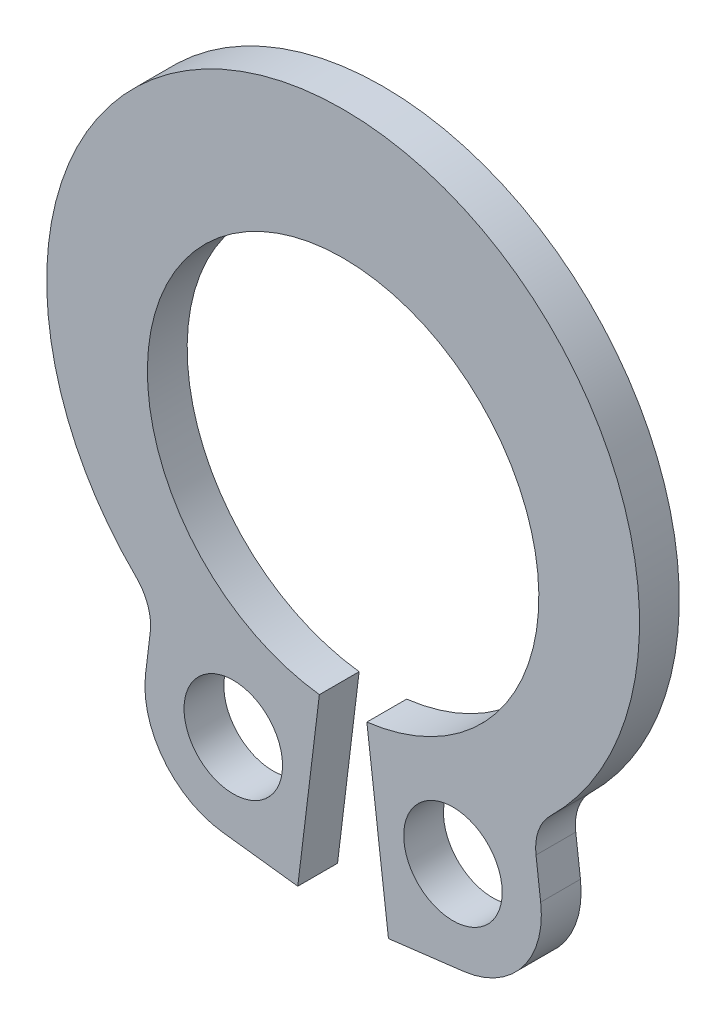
ISO-10303-21;
HEADER;
FILE_DESCRIPTION(('STEP AP214'),'2;1');
FILE_NAME('part.step','',(''),(''),'','','');
FILE_SCHEMA(('AUTOMOTIVE_DESIGN { 1 0 10303 214 1 1 1 1 }'));
ENDSEC;
DATA;
#1=APPLICATION_CONTEXT('core data for automotive mechanical design processes');
#2=APPLICATION_PROTOCOL_DEFINITION('international standard','automotive_design',2000,#1);
#3=PRODUCT_CONTEXT('',#1,'mechanical');
#4=PRODUCT('Part','Part','',(#3));
#5=PRODUCT_RELATED_PRODUCT_CATEGORY('part','',(#4));
#6=PRODUCT_DEFINITION_FORMATION('','',#4);
#7=PRODUCT_DEFINITION_CONTEXT('part definition',#1,'design');
#8=PRODUCT_DEFINITION('design','',#6,#7);
#9=PRODUCT_DEFINITION_SHAPE('','',#8);
#10=(LENGTH_UNIT() NAMED_UNIT(*) SI_UNIT(.MILLI.,.METRE.));
#11=(NAMED_UNIT(*) PLANE_ANGLE_UNIT() SI_UNIT($,.RADIAN.));
#12=(NAMED_UNIT(*) SI_UNIT($,.STERADIAN.) SOLID_ANGLE_UNIT());
#13=UNCERTAINTY_MEASURE_WITH_UNIT(LENGTH_MEASURE(1.E-05),#10,'distance_accuracy_value','');
#14=(GEOMETRIC_REPRESENTATION_CONTEXT(3) GLOBAL_UNCERTAINTY_ASSIGNED_CONTEXT((#13)) GLOBAL_UNIT_ASSIGNED_CONTEXT((#10,
#11,#12)) REPRESENTATION_CONTEXT('',''));
#15=CARTESIAN_POINT('',(0.,0.,0.));
#16=DIRECTION('',(0.,0.,1.));
#17=DIRECTION('',(1.,0.,0.));
#18=AXIS2_PLACEMENT_3D('',#15,#16,#17);
#19=CARTESIAN_POINT('',(0.,0.,-0.799999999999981));
#20=DIRECTION('',(0.,0.,1.));
#21=DIRECTION('',(0.999999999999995,0.,0.));
#22=AXIS2_PLACEMENT_3D('',#19,#20,#21);
#23=CYLINDRICAL_SURFACE('',#22,3.937);
#24=CARTESIAN_POINT('',(0.,0.,0.));
#25=DIRECTION('',(0.,0.,-1.));
#26=DIRECTION('',(0.999999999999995,0.,0.));
#27=AXIS2_PLACEMENT_3D('',#24,#25,#26);
#28=CIRCLE('',#27,3.937);
#29=CARTESIAN_POINT('',(-0.477599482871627,-3.90792371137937,-7.49400541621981E-13));
#30=VERTEX_POINT('',#29);
#31=CARTESIAN_POINT('',(0.477599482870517,-3.90792371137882,0.));
#32=VERTEX_POINT('',#31);
#33=EDGE_CURVE('E155',#30,#32,#28,.T.);
#34=ORIENTED_EDGE('',*,*,#33,.F.);
#35=DIRECTION('',(0.,0.,1.));
#36=VECTOR('',#35,1.);
#37=CARTESIAN_POINT('',(-0.477599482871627,-3.90792371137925,-0.800000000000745));
#38=LINE('',#37,#36);
#39=CARTESIAN_POINT('',(-0.477599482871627,-3.90792371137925,-0.800000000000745));
#40=VERTEX_POINT('',#39);
#41=EDGE_CURVE('E11',#40,#30,#38,.T.);
#42=ORIENTED_EDGE('',*,*,#41,.F.);
#43=CARTESIAN_POINT('',(0.,0.,-0.799999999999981));
#44=DIRECTION('',(0.,0.,-1.));
#45=DIRECTION('',(0.999999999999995,0.,0.));
#46=AXIS2_PLACEMENT_3D('',#43,#44,#45);
#47=CIRCLE('',#46,3.937);
#48=CARTESIAN_POINT('',(0.47759948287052,-3.90792371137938,-0.800000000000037));
#49=VERTEX_POINT('',#48);
#50=EDGE_CURVE('E188',#40,#49,#47,.T.);
#51=ORIENTED_EDGE('',*,*,#50,.T.);
#52=DIRECTION('',(0.,0.,1.));
#53=VECTOR('',#52,1.);
#54=CARTESIAN_POINT('',(0.47759948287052,-3.90792371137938,-0.800000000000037));
#55=LINE('',#54,#53);
#56=EDGE_CURVE('E37',#49,#32,#55,.T.);
#57=ORIENTED_EDGE('',*,*,#56,.T.);
#58=EDGE_LOOP('',(#34,#42,#51,#57));
#59=FACE_BOUND('',#58,.T.);
#60=ADVANCED_FACE('F34',(#59),#23,.F.);
#61=CARTESIAN_POINT('',(-0.477599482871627,-3.90792371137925,-0.800000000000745));
#62=DIRECTION('',(0.992614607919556,-0.121310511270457,0.));
#63=DIRECTION('',(0.121310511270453,0.992614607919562,0.));
#64=AXIS2_PLACEMENT_3D('',#61,#62,#63);
#65=PLANE('',#64);
#66=DIRECTION('',(0.121310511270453,0.992614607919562,0.));
#67=VECTOR('',#66,1.);
#68=CARTESIAN_POINT('',(-0.477599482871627,-3.90792371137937,-7.49400541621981E-13));
#69=LINE('',#68,#67);
#70=CARTESIAN_POINT('',(-0.91206094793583,-7.4628736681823,0.));
#71=VERTEX_POINT('',#70);
#72=EDGE_CURVE('E186',#71,#30,#69,.T.);
#73=ORIENTED_EDGE('',*,*,#72,.F.);
#74=DIRECTION('',(0.,0.,1.));
#75=VECTOR('',#74,1.);
#76=CARTESIAN_POINT('',(-0.912060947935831,-7.46287366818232,-0.800000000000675));
#77=LINE('',#76,#75);
#78=CARTESIAN_POINT('',(-0.912060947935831,-7.46287366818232,-0.800000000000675));
#79=VERTEX_POINT('',#78);
#80=EDGE_CURVE('E43',#79,#71,#77,.T.);
#81=ORIENTED_EDGE('',*,*,#80,.F.);
#82=DIRECTION('',(0.121310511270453,0.992614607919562,0.));
#83=VECTOR('',#82,1.);
#84=CARTESIAN_POINT('',(-0.477599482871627,-3.90792371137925,-0.800000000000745));
#85=LINE('',#84,#83);
#86=EDGE_CURVE('E145',#79,#40,#85,.T.);
#87=ORIENTED_EDGE('',*,*,#86,.T.);
#88=ORIENTED_EDGE('',*,*,#41,.T.);
#89=EDGE_LOOP('',(#73,#81,#87,#88));
#90=FACE_BOUND('',#89,.T.);
#91=ADVANCED_FACE('F208',(#90),#65,.T.);
#92=CARTESIAN_POINT('',(-0.912060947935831,-7.46287366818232,-0.800000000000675));
#93=DIRECTION('',(-0.121310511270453,-0.992614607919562,0.));
#94=DIRECTION('',(0.992614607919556,-0.121310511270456,0.));
#95=AXIS2_PLACEMENT_3D('',#92,#93,#94);
#96=PLANE('',#95);
#97=DIRECTION('',(0.992614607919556,-0.121310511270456,0.));
#98=VECTOR('',#97,1.);
#99=CARTESIAN_POINT('',(-0.91206094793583,-7.4628736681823,0.));
#100=LINE('',#99,#98);
#101=CARTESIAN_POINT('',(-2.42480561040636,-7.27799644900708,-5.27355936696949E-13));
#102=VERTEX_POINT('',#101);
#103=EDGE_CURVE('E132',#102,#71,#100,.T.);
#104=ORIENTED_EDGE('',*,*,#103,.F.);
#105=DIRECTION('',(0.,0.,1.));
#106=VECTOR('',#105,1.);
#107=CARTESIAN_POINT('',(-2.42480561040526,-7.27799644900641,-0.799999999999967));
#108=LINE('',#107,#106);
#109=CARTESIAN_POINT('',(-2.42480561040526,-7.27799644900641,-0.799999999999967));
#110=VERTEX_POINT('',#109);
#111=EDGE_CURVE('E127',#110,#102,#108,.T.);
#112=ORIENTED_EDGE('',*,*,#111,.F.);
#113=DIRECTION('',(0.992614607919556,-0.121310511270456,0.));
#114=VECTOR('',#113,1.);
#115=CARTESIAN_POINT('',(-0.912060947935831,-7.46287366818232,-0.800000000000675));
#116=LINE('',#115,#114);
#117=EDGE_CURVE('E130',#110,#79,#116,.T.);
#118=ORIENTED_EDGE('',*,*,#117,.T.);
#119=ORIENTED_EDGE('',*,*,#80,.T.);
#120=EDGE_LOOP('',(#104,#112,#118,#119));
#121=FACE_BOUND('',#120,.T.);
#122=ADVANCED_FACE('F129',(#121),#96,.T.);
#123=CARTESIAN_POINT('',(-2.20911552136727,-5.51312767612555,-0.800000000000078));
#124=DIRECTION('',(0.,0.,1.));
#125=DIRECTION('',(0.999999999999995,0.,0.));
#126=AXIS2_PLACEMENT_3D('',#123,#124,#125);
#127=CYLINDRICAL_SURFACE('',#126,1.778);
#128=CARTESIAN_POINT('',(-2.20911552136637,-5.51312767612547,0.));
#129=DIRECTION('',(0.,0.,1.));
#130=DIRECTION('',(0.999999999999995,0.,0.));
#131=AXIS2_PLACEMENT_3D('',#128,#129,#130);
#132=CIRCLE('',#131,1.778);
#133=CARTESIAN_POINT('',(-3.97398429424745,-5.29743758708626,-7.84095011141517E-13));
#134=VERTEX_POINT('',#133);
#135=EDGE_CURVE('E183',#134,#102,#132,.T.);
#136=ORIENTED_EDGE('',*,*,#135,.F.);
#137=DIRECTION('',(0.,0.,1.));
#138=VECTOR('',#137,1.);
#139=CARTESIAN_POINT('',(-3.97398429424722,-5.29743758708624,-0.800000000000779));
#140=LINE('',#139,#138);
#141=CARTESIAN_POINT('',(-3.97398429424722,-5.29743758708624,-0.800000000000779));
#142=VERTEX_POINT('',#141);
#143=EDGE_CURVE('E137',#142,#134,#140,.T.);
#144=ORIENTED_EDGE('',*,*,#143,.F.);
#145=CARTESIAN_POINT('',(-2.20911552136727,-5.51312767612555,-0.800000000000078));
#146=DIRECTION('',(0.,0.,1.));
#147=DIRECTION('',(0.999999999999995,0.,0.));
#148=AXIS2_PLACEMENT_3D('',#145,#146,#147);
#149=CIRCLE('',#148,1.778);
#150=EDGE_CURVE('E143',#142,#110,#149,.T.);
#151=ORIENTED_EDGE('',*,*,#150,.T.);
#152=ORIENTED_EDGE('',*,*,#111,.T.);
#153=EDGE_LOOP('',(#136,#144,#151,#152));
#154=FACE_BOUND('',#153,.T.);
#155=ADVANCED_FACE('F147',(#154),#127,.T.);
#156=CARTESIAN_POINT('',(-3.87942912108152,-4.52374662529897,-0.799999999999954));
#157=DIRECTION('',(-0.992614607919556,0.121310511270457,0.));
#158=DIRECTION('',(-0.121310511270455,-0.992614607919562,0.));
#159=AXIS2_PLACEMENT_3D('',#156,#157,#158);
#160=PLANE('',#159);
#161=DIRECTION('',(-0.121310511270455,-0.992614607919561,0.));
#162=VECTOR('',#161,1.);
#163=CARTESIAN_POINT('',(-3.8794291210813,-4.52374662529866,0.));
#164=LINE('',#163,#162);
#165=CARTESIAN_POINT('',(-3.8794291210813,-4.52374662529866,0.));
#166=VERTEX_POINT('',#165);
#167=EDGE_CURVE('E180',#166,#134,#164,.T.);
#168=ORIENTED_EDGE('',*,*,#167,.F.);
#169=DIRECTION('',(0.,0.,1.));
#170=VECTOR('',#169,1.);
#171=CARTESIAN_POINT('',(-3.87942912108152,-4.52374662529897,-0.799999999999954));
#172=LINE('',#171,#170);
#173=CARTESIAN_POINT('',(-3.87942912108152,-4.52374662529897,-0.799999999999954));
#174=VERTEX_POINT('',#173);
#175=EDGE_CURVE('E192',#174,#166,#172,.T.);
#176=ORIENTED_EDGE('',*,*,#175,.F.);
#177=DIRECTION('',(-0.121310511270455,-0.992614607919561,0.));
#178=VECTOR('',#177,1.);
#179=CARTESIAN_POINT('',(-3.87942912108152,-4.52374662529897,-0.799999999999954));
#180=LINE('',#179,#178);
#181=EDGE_CURVE('E148',#174,#142,#180,.T.);
#182=ORIENTED_EDGE('',*,*,#181,.T.);
#183=ORIENTED_EDGE('',*,*,#143,.T.);
#184=EDGE_LOOP('',(#168,#176,#182,#183));
#185=FACE_BOUND('',#184,.T.);
#186=ADVANCED_FACE('F221',(#185),#160,.T.);
#187=CARTESIAN_POINT('',(-4.86271315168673,-4.40357643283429,-0.799999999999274));
#188=DIRECTION('',(0.,0.,1.));
#189=DIRECTION('',(0.999999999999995,0.,0.));
#190=AXIS2_PLACEMENT_3D('',#187,#188,#189);
#191=CYLINDRICAL_SURFACE('',#190,0.990599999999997);
#192=CARTESIAN_POINT('',(-4.86271315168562,-4.40357643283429,-7.7715611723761E-13));
#193=DIRECTION('',(0.,0.,-1.));
#194=DIRECTION('',(0.999999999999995,0.,0.));
#195=AXIS2_PLACEMENT_3D('',#192,#193,#194);
#196=CIRCLE('',#195,0.990599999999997);
#197=CARTESIAN_POINT('',(-4.16988679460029,-3.69556513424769,0.));
#198=VERTEX_POINT('',#197);
#199=EDGE_CURVE('E177',#198,#166,#196,.T.);
#200=ORIENTED_EDGE('',*,*,#199,.F.);
#201=DIRECTION('',(0.,0.,1.));
#202=VECTOR('',#201,1.);
#203=CARTESIAN_POINT('',(-4.16988679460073,-3.69556513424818,-0.800000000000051));
#204=LINE('',#203,#202);
#205=CARTESIAN_POINT('',(-4.16988679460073,-3.69556513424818,-0.800000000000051));
#206=VERTEX_POINT('',#205);
#207=EDGE_CURVE('E194',#206,#198,#204,.T.);
#208=ORIENTED_EDGE('',*,*,#207,.F.);
#209=CARTESIAN_POINT('',(-4.86271315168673,-4.40357643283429,-0.799999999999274));
#210=DIRECTION('',(0.,0.,-1.));
#211=DIRECTION('',(0.999999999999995,0.,0.));
#212=AXIS2_PLACEMENT_3D('',#209,#210,#211);
#213=CIRCLE('',#212,0.990599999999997);
#214=EDGE_CURVE('E150',#206,#174,#213,.T.);
#215=ORIENTED_EDGE('',*,*,#214,.T.);
#216=ORIENTED_EDGE('',*,*,#175,.T.);
#217=EDGE_LOOP('',(#200,#208,#215,#216));
#218=FACE_BOUND('',#217,.T.);
#219=ADVANCED_FACE('F224',(#218),#191,.F.);
#220=CARTESIAN_POINT('',(-1.55344487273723E-12,0.565714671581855,-0.800000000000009));
#221=DIRECTION('',(0.,0.,1.));
#222=DIRECTION('',(0.999999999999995,0.,0.));
#223=AXIS2_PLACEMENT_3D('',#220,#221,#222);
#224=CYLINDRICAL_SURFACE('',#223,5.96208532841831);
#225=CARTESIAN_POINT('',(-1.9966667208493E-12,0.565714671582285,0.));
#226=DIRECTION('',(0.,0.,1.));
#227=DIRECTION('',(0.999999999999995,0.,0.));
#228=AXIS2_PLACEMENT_3D('',#225,#226,#227);
#229=CIRCLE('',#228,5.96208532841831);
#230=CARTESIAN_POINT('',(4.16988679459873,-3.69556513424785,0.));
#231=VERTEX_POINT('',#230);
#232=EDGE_CURVE('E174',#231,#198,#229,.T.);
#233=ORIENTED_EDGE('',*,*,#232,.F.);
#234=DIRECTION('',(0.,0.,1.));
#235=VECTOR('',#234,1.);
#236=CARTESIAN_POINT('',(4.16988679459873,-3.69556513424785,-0.799999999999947));
#237=LINE('',#236,#235);
#238=CARTESIAN_POINT('',(4.16988679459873,-3.69556513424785,-0.799999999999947));
#239=VERTEX_POINT('',#238);
#240=EDGE_CURVE('E196',#239,#231,#237,.T.);
#241=ORIENTED_EDGE('',*,*,#240,.F.);
#242=CARTESIAN_POINT('',(-1.55344487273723E-12,0.565714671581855,-0.800000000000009));
#243=DIRECTION('',(0.,0.,1.));
#244=DIRECTION('',(0.999999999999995,0.,0.));
#245=AXIS2_PLACEMENT_3D('',#242,#243,#244);
#246=CIRCLE('',#245,5.96208532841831);
#247=EDGE_CURVE('E298',#239,#206,#246,.T.);
#248=ORIENTED_EDGE('',*,*,#247,.T.);
#249=ORIENTED_EDGE('',*,*,#207,.T.);
#250=EDGE_LOOP('',(#233,#241,#248,#249));
#251=FACE_BOUND('',#250,.T.);
#252=ADVANCED_FACE('F228',(#251),#224,.T.);
#253=CARTESIAN_POINT('',(4.86271315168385,-4.4035764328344,-0.800000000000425));
#254=DIRECTION('',(0.,0.,1.));
#255=DIRECTION('',(0.999999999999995,0.,0.));
#256=AXIS2_PLACEMENT_3D('',#253,#254,#255);
#257=CYLINDRICAL_SURFACE('',#256,0.990599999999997);
#258=CARTESIAN_POINT('',(4.86271315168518,-4.40357643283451,0.));
#259=DIRECTION('',(0.,0.,-1.));
#260=DIRECTION('',(0.999999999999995,0.,0.));
#261=AXIS2_PLACEMENT_3D('',#258,#259,#260);
#262=CIRCLE('',#261,0.990599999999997);
#263=CARTESIAN_POINT('',(3.87942912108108,-4.52374662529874,0.));
#264=VERTEX_POINT('',#263);
#265=EDGE_CURVE('E171',#264,#231,#262,.T.);
#266=ORIENTED_EDGE('',*,*,#265,.F.);
#267=DIRECTION('',(0.,0.,1.));
#268=VECTOR('',#267,1.);
#269=CARTESIAN_POINT('',(3.87942912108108,-4.52374662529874,-0.799999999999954));
#270=LINE('',#269,#268);
#271=CARTESIAN_POINT('',(3.87942912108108,-4.52374662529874,-0.799999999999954));
#272=VERTEX_POINT('',#271);
#273=EDGE_CURVE('E198',#272,#264,#270,.T.);
#274=ORIENTED_EDGE('',*,*,#273,.F.);
#275=CARTESIAN_POINT('',(4.86271315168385,-4.4035764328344,-0.800000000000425));
#276=DIRECTION('',(0.,0.,-1.));
#277=DIRECTION('',(0.999999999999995,0.,0.));
#278=AXIS2_PLACEMENT_3D('',#275,#276,#277);
#279=CIRCLE('',#278,0.990599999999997);
#280=EDGE_CURVE('E295',#272,#239,#279,.T.);
#281=ORIENTED_EDGE('',*,*,#280,.T.);
#282=ORIENTED_EDGE('',*,*,#240,.T.);
#283=EDGE_LOOP('',(#266,#274,#281,#282));
#284=FACE_BOUND('',#283,.T.);
#285=ADVANCED_FACE('F232',(#284),#257,.F.);
#286=CARTESIAN_POINT('',(3.87942912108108,-4.52374662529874,-0.799999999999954));
#287=DIRECTION('',(0.992614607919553,0.121310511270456,0.));
#288=DIRECTION('',(-0.121310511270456,0.992614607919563,0.));
#289=AXIS2_PLACEMENT_3D('',#286,#287,#288);
#290=PLANE('',#289);
#291=DIRECTION('',(-0.121310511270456,0.992614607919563,0.));
#292=VECTOR('',#291,1.);
#293=CARTESIAN_POINT('',(3.87942912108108,-4.52374662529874,0.));
#294=LINE('',#293,#292);
#295=CARTESIAN_POINT('',(3.97398429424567,-5.29743758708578,0.));
#296=VERTEX_POINT('',#295);
#297=EDGE_CURVE('E168',#296,#264,#294,.T.);
#298=ORIENTED_EDGE('',*,*,#297,.F.);
#299=DIRECTION('',(0.,0.,1.));
#300=VECTOR('',#299,1.);
#301=CARTESIAN_POINT('',(3.97398429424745,-5.29743758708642,-0.800000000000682));
#302=LINE('',#301,#300);
#303=CARTESIAN_POINT('',(3.97398429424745,-5.29743758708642,-0.800000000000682));
#304=VERTEX_POINT('',#303);
#305=EDGE_CURVE('E200',#304,#296,#302,.T.);
#306=ORIENTED_EDGE('',*,*,#305,.F.);
#307=DIRECTION('',(-0.121310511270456,0.992614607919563,0.));
#308=VECTOR('',#307,1.);
#309=CARTESIAN_POINT('',(3.87942912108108,-4.52374662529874,-0.799999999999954));
#310=LINE('',#309,#308);
#311=EDGE_CURVE('E292',#304,#272,#310,.T.);
#312=ORIENTED_EDGE('',*,*,#311,.T.);
#313=ORIENTED_EDGE('',*,*,#273,.T.);
#314=EDGE_LOOP('',(#298,#306,#312,#313));
#315=FACE_BOUND('',#314,.T.);
#316=ADVANCED_FACE('F236',(#315),#290,.T.);
#317=CARTESIAN_POINT('',(2.2091155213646,-5.51312767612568,-0.800000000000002));
#318=DIRECTION('',(0.,0.,1.));
#319=DIRECTION('',(0.999999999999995,0.,0.));
#320=AXIS2_PLACEMENT_3D('',#317,#318,#319);
#321=CYLINDRICAL_SURFACE('',#320,1.778);
#322=CARTESIAN_POINT('',(2.20911552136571,-5.51312767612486,7.21644966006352E-13));
#323=DIRECTION('',(0.,0.,1.));
#324=DIRECTION('',(0.999999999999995,0.,0.));
#325=AXIS2_PLACEMENT_3D('',#322,#323,#324);
#326=CIRCLE('',#325,1.778);
#327=CARTESIAN_POINT('',(2.42480561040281,-7.27799644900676,-5.55111512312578E-13));
#328=VERTEX_POINT('',#327);
#329=EDGE_CURVE('E165',#328,#296,#326,.T.);
#330=ORIENTED_EDGE('',*,*,#329,.F.);
#331=DIRECTION('',(0.,0.,1.));
#332=VECTOR('',#331,1.);
#333=CARTESIAN_POINT('',(2.42480561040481,-7.27799644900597,-0.800000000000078));
#334=LINE('',#333,#332);
#335=CARTESIAN_POINT('',(2.42480561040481,-7.27799644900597,-0.800000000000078));
#336=VERTEX_POINT('',#335);
#337=EDGE_CURVE('E202',#336,#328,#334,.T.);
#338=ORIENTED_EDGE('',*,*,#337,.F.);
#339=CARTESIAN_POINT('',(2.2091155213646,-5.51312767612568,-0.800000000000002));
#340=DIRECTION('',(0.,0.,1.));
#341=DIRECTION('',(0.999999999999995,0.,0.));
#342=AXIS2_PLACEMENT_3D('',#339,#340,#341);
#343=CIRCLE('',#342,1.778);
#344=EDGE_CURVE('E289',#336,#304,#343,.T.);
#345=ORIENTED_EDGE('',*,*,#344,.T.);
#346=ORIENTED_EDGE('',*,*,#305,.T.);
#347=EDGE_LOOP('',(#330,#338,#345,#346));
#348=FACE_BOUND('',#347,.T.);
#349=ADVANCED_FACE('F240',(#348),#321,.T.);
#350=CARTESIAN_POINT('',(0.912060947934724,-7.46287366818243,-0.799999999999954));
#351=DIRECTION('',(0.121310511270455,-0.992614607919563,0.));
#352=DIRECTION('',(0.992614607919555,0.121310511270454,0.));
#353=AXIS2_PLACEMENT_3D('',#350,#351,#352);
#354=PLANE('',#353);
#355=DIRECTION('',(0.992614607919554,0.121310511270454,0.));
#356=VECTOR('',#355,1.);
#357=CARTESIAN_POINT('',(0.912060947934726,-7.46287366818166,7.42461647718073E-13));
#358=LINE('',#357,#356);
#359=CARTESIAN_POINT('',(0.912060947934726,-7.46287366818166,7.42461647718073E-13));
#360=VERTEX_POINT('',#359);
#361=EDGE_CURVE('E162',#360,#328,#358,.T.);
#362=ORIENTED_EDGE('',*,*,#361,.F.);
#363=DIRECTION('',(0.,0.,1.));
#364=VECTOR('',#363,1.);
#365=CARTESIAN_POINT('',(0.912060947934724,-7.46287366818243,-0.799999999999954));
#366=LINE('',#365,#364);
#367=CARTESIAN_POINT('',(0.912060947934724,-7.46287366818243,-0.799999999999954));
#368=VERTEX_POINT('',#367);
#369=EDGE_CURVE('E203',#368,#360,#366,.T.);
#370=ORIENTED_EDGE('',*,*,#369,.F.);
#371=DIRECTION('',(0.992614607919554,0.121310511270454,0.));
#372=VECTOR('',#371,1.);
#373=CARTESIAN_POINT('',(0.912060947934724,-7.46287366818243,-0.799999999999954));
#374=LINE('',#373,#372);
#375=EDGE_CURVE('E286',#368,#336,#374,.T.);
#376=ORIENTED_EDGE('',*,*,#375,.T.);
#377=ORIENTED_EDGE('',*,*,#337,.T.);
#378=EDGE_LOOP('',(#362,#370,#376,#377));
#379=FACE_BOUND('',#378,.T.);
#380=ADVANCED_FACE('F244',(#379),#354,.T.);
#381=CARTESIAN_POINT('',(0.47759948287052,-3.90792371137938,-0.800000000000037));
#382=DIRECTION('',(-0.992614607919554,-0.121310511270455,0.));
#383=DIRECTION('',(0.121310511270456,-0.992614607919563,0.));
#384=AXIS2_PLACEMENT_3D('',#381,#382,#383);
#385=PLANE('',#384);
#386=DIRECTION('',(0.121310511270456,-0.992614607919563,0.));
#387=VECTOR('',#386,1.);
#388=CARTESIAN_POINT('',(0.477599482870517,-3.90792371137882,0.));
#389=LINE('',#388,#387);
#390=EDGE_CURVE('E158',#32,#360,#389,.T.);
#391=ORIENTED_EDGE('',*,*,#390,.F.);
#392=ORIENTED_EDGE('',*,*,#56,.F.);
#393=DIRECTION('',(0.121310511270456,-0.992614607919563,0.));
#394=VECTOR('',#393,1.);
#395=CARTESIAN_POINT('',(0.47759948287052,-3.90792371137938,-0.800000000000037));
#396=LINE('',#395,#394);
#397=EDGE_CURVE('E284',#49,#368,#396,.T.);
#398=ORIENTED_EDGE('',*,*,#397,.T.);
#399=ORIENTED_EDGE('',*,*,#369,.T.);
#400=EDGE_LOOP('',(#391,#392,#398,#399));
#401=FACE_BOUND('',#400,.T.);
#402=ADVANCED_FACE('F205',(#401),#385,.T.);
#403=CARTESIAN_POINT('',(0.,0.,-0.799999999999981));
#404=DIRECTION('',(0.,0.,1.));
#405=DIRECTION('',(0.999999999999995,0.,0.));
#406=AXIS2_PLACEMENT_3D('',#403,#404,#405);
#407=PLANE('',#406);
#408=CARTESIAN_POINT('',(-2.20911552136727,-5.51312767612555,-0.800000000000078));
#409=DIRECTION('',(0.,0.,1.));
#410=DIRECTION('',(0.999999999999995,0.,0.));
#411=AXIS2_PLACEMENT_3D('',#408,#409,#410);
#412=CIRCLE('',#411,0.9906);
#413=CARTESIAN_POINT('',(-1.21851552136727,-5.51312767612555,-0.800000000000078));
#414=VERTEX_POINT('',#413);
#415=EDGE_CURVE('E271',#414,#414,#412,.T.);
#416=ORIENTED_EDGE('',*,*,#415,.T.);
#417=EDGE_LOOP('',(#416));
#418=FACE_BOUND('',#417,.T.);
#419=CARTESIAN_POINT('',(2.2091155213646,-5.51312767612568,-0.800000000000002));
#420=DIRECTION('',(0.,0.,1.));
#421=DIRECTION('',(0.999999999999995,0.,0.));
#422=AXIS2_PLACEMENT_3D('',#419,#420,#421);
#423=CIRCLE('',#422,0.9906);
#424=CARTESIAN_POINT('',(3.1997155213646,-5.51312767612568,-0.800000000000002));
#425=VERTEX_POINT('',#424);
#426=EDGE_CURVE('E159',#425,#425,#423,.T.);
#427=ORIENTED_EDGE('',*,*,#426,.T.);
#428=EDGE_LOOP('',(#427));
#429=FACE_BOUND('',#428,.T.);
#430=ORIENTED_EDGE('',*,*,#50,.F.);
#431=ORIENTED_EDGE('',*,*,#86,.F.);
#432=ORIENTED_EDGE('',*,*,#117,.F.);
#433=ORIENTED_EDGE('',*,*,#150,.F.);
#434=ORIENTED_EDGE('',*,*,#181,.F.);
#435=ORIENTED_EDGE('',*,*,#214,.F.);
#436=ORIENTED_EDGE('',*,*,#247,.F.);
#437=ORIENTED_EDGE('',*,*,#280,.F.);
#438=ORIENTED_EDGE('',*,*,#311,.F.);
#439=ORIENTED_EDGE('',*,*,#344,.F.);
#440=ORIENTED_EDGE('',*,*,#375,.F.);
#441=ORIENTED_EDGE('',*,*,#397,.F.);
#442=EDGE_LOOP('',(#430,#431,#432,#433,#434,#435,#436,#437,#438,#439,#440,#441));
#443=FACE_BOUND('',#442,.T.);
#444=ADVANCED_FACE('F141',(#418,#429,#443),#407,.F.);
#445=CARTESIAN_POINT('',(0.,0.,0.));
#446=DIRECTION('',(0.,0.,1.));
#447=DIRECTION('',(0.999999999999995,0.,0.));
#448=AXIS2_PLACEMENT_3D('',#445,#446,#447);
#449=PLANE('',#448);
#450=CARTESIAN_POINT('',(-2.20911552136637,-5.51312767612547,0.));
#451=DIRECTION('',(0.,0.,1.));
#452=DIRECTION('',(0.999999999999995,0.,0.));
#453=AXIS2_PLACEMENT_3D('',#450,#451,#452);
#454=CIRCLE('',#453,0.9906);
#455=CARTESIAN_POINT('',(-1.21851552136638,-5.51312767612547,0.));
#456=VERTEX_POINT('',#455);
#457=EDGE_CURVE('E274',#456,#456,#454,.T.);
#458=ORIENTED_EDGE('',*,*,#457,.F.);
#459=EDGE_LOOP('',(#458));
#460=FACE_BOUND('',#459,.T.);
#461=CARTESIAN_POINT('',(2.20911552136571,-5.51312767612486,7.21644966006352E-13));
#462=DIRECTION('',(0.,0.,1.));
#463=DIRECTION('',(0.999999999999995,0.,0.));
#464=AXIS2_PLACEMENT_3D('',#461,#462,#463);
#465=CIRCLE('',#464,0.9906);
#466=CARTESIAN_POINT('',(3.19971552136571,-5.51312767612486,7.22064259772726E-13));
#467=VERTEX_POINT('',#466);
#468=EDGE_CURVE('E276',#467,#467,#465,.T.);
#469=ORIENTED_EDGE('',*,*,#468,.F.);
#470=EDGE_LOOP('',(#469));
#471=FACE_BOUND('',#470,.T.);
#472=ORIENTED_EDGE('',*,*,#33,.T.);
#473=ORIENTED_EDGE('',*,*,#390,.T.);
#474=ORIENTED_EDGE('',*,*,#361,.T.);
#475=ORIENTED_EDGE('',*,*,#329,.T.);
#476=ORIENTED_EDGE('',*,*,#297,.T.);
#477=ORIENTED_EDGE('',*,*,#265,.T.);
#478=ORIENTED_EDGE('',*,*,#232,.T.);
#479=ORIENTED_EDGE('',*,*,#199,.T.);
#480=ORIENTED_EDGE('',*,*,#167,.T.);
#481=ORIENTED_EDGE('',*,*,#135,.T.);
#482=ORIENTED_EDGE('',*,*,#103,.T.);
#483=ORIENTED_EDGE('',*,*,#72,.T.);
#484=EDGE_LOOP('',(#472,#473,#474,#475,#476,#477,#478,#479,#480,#481,#482,#483));
#485=FACE_BOUND('',#484,.T.);
#486=ADVANCED_FACE('F207',(#460,#471,#485),#449,.T.);
#487=CARTESIAN_POINT('',(2.2091155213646,-5.51312767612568,-0.800000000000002));
#488=DIRECTION('',(0.,0.,1.));
#489=DIRECTION('',(0.999999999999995,0.,0.));
#490=AXIS2_PLACEMENT_3D('',#487,#488,#489);
#491=CYLINDRICAL_SURFACE('',#490,0.9906);
#492=ORIENTED_EDGE('',*,*,#426,.F.);
#493=EDGE_LOOP('',(#492));
#494=FACE_BOUND('',#493,.T.);
#495=ORIENTED_EDGE('',*,*,#468,.T.);
#496=EDGE_LOOP('',(#495));
#497=FACE_BOUND('',#496,.T.);
#498=ADVANCED_FACE('F256',(#494,#497),#491,.F.);
#499=CARTESIAN_POINT('',(-2.20911552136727,-5.51312767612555,-0.800000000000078));
#500=DIRECTION('',(0.,0.,1.));
#501=DIRECTION('',(0.999999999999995,0.,0.));
#502=AXIS2_PLACEMENT_3D('',#499,#500,#501);
#503=CYLINDRICAL_SURFACE('',#502,0.9906);
#504=ORIENTED_EDGE('',*,*,#415,.F.);
#505=EDGE_LOOP('',(#504));
#506=FACE_BOUND('',#505,.T.);
#507=ORIENTED_EDGE('',*,*,#457,.T.);
#508=EDGE_LOOP('',(#507));
#509=FACE_BOUND('',#508,.T.);
#510=ADVANCED_FACE('F263',(#506,#509),#503,.F.);
#511=CLOSED_SHELL('',(#60,#91,#122,#155,#186,#219,#252,#285,#316,#349,#380,#402,#444,#486,#498,#510));
#512=MANIFOLD_SOLID_BREP('B2',#511);
#513=ADVANCED_BREP_SHAPE_REPRESENTATION('',(#18,#512),#14);
#514=SHAPE_DEFINITION_REPRESENTATION(#9,#513);
ENDSEC;
END-ISO-10303-21;
